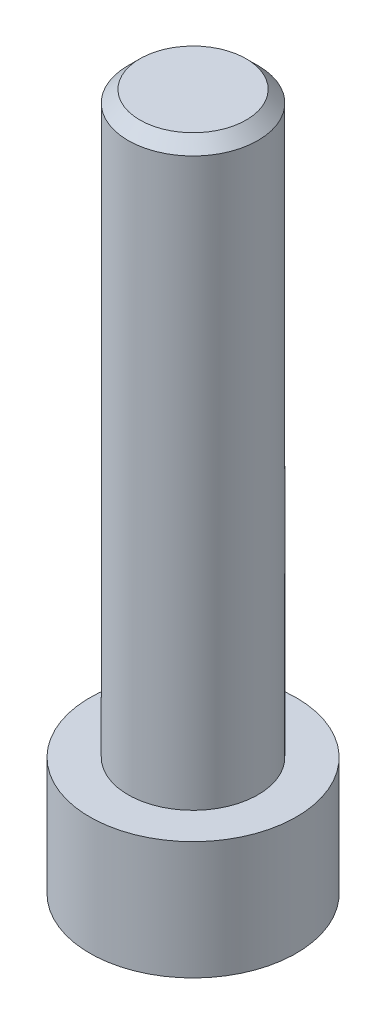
ISO-10303-21;
HEADER;
FILE_DESCRIPTION(('STEP AP214'),'2;1');
FILE_NAME('part.step','',(''),(''),'','','');
FILE_SCHEMA(('AUTOMOTIVE_DESIGN { 1 0 10303 214 1 1 1 1 }'));
ENDSEC;
DATA;
#1=APPLICATION_CONTEXT('core data for automotive mechanical design processes');
#2=APPLICATION_PROTOCOL_DEFINITION('international standard','automotive_design',2000,#1);
#3=PRODUCT_CONTEXT('',#1,'mechanical');
#4=PRODUCT('Part','Part','',(#3));
#5=PRODUCT_RELATED_PRODUCT_CATEGORY('part','',(#4));
#6=PRODUCT_DEFINITION_FORMATION('','',#4);
#7=PRODUCT_DEFINITION_CONTEXT('part definition',#1,'design');
#8=PRODUCT_DEFINITION('design','',#6,#7);
#9=PRODUCT_DEFINITION_SHAPE('','',#8);
#10=(LENGTH_UNIT() NAMED_UNIT(*) SI_UNIT(.MILLI.,.METRE.));
#11=(NAMED_UNIT(*) PLANE_ANGLE_UNIT() SI_UNIT($,.RADIAN.));
#12=(NAMED_UNIT(*) SI_UNIT($,.STERADIAN.) SOLID_ANGLE_UNIT());
#13=UNCERTAINTY_MEASURE_WITH_UNIT(LENGTH_MEASURE(1.E-05),#10,'distance_accuracy_value','');
#14=(GEOMETRIC_REPRESENTATION_CONTEXT(3) GLOBAL_UNCERTAINTY_ASSIGNED_CONTEXT((#13)) GLOBAL_UNIT_ASSIGNED_CONTEXT((#10,
#11,#12)) REPRESENTATION_CONTEXT('',''));
#15=CARTESIAN_POINT('',(0.,0.,0.));
#16=DIRECTION('',(0.,0.,1.));
#17=DIRECTION('',(1.,0.,0.));
#18=AXIS2_PLACEMENT_3D('',#15,#16,#17);
#19=CARTESIAN_POINT('',(14.518,-10.1170000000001,22.4846));
#20=DIRECTION('',(0.,1.,0.));
#21=DIRECTION('',(0.,0.,1.));
#22=AXIS2_PLACEMENT_3D('',#19,#20,#21);
#23=PLANE('',#22);
#24=DIRECTION('',(-1.,0.,0.));
#25=VECTOR('',#24,1.);
#26=CARTESIAN_POINT('',(13.883,-10.117,21.3847477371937));
#27=LINE('',#26,#25);
#28=CARTESIAN_POINT('',(13.883,-10.1170000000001,21.3847477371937));
#29=VERTEX_POINT('',#28);
#30=CARTESIAN_POINT('',(15.153,-10.1170000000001,21.3847477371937));
#31=VERTEX_POINT('',#30);
#32=EDGE_CURVE('E90',#29,#31,#27,.F.);
#33=ORIENTED_EDGE('',*,*,#32,.T.);
#34=DIRECTION('',(-0.500000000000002,0.,-0.866025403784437));
#35=VECTOR('',#34,1.);
#36=CARTESIAN_POINT('',(15.153,-10.117,21.3847477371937));
#37=LINE('',#36,#35);
#38=CARTESIAN_POINT('',(15.788,-10.1170000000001,22.4846));
#39=VERTEX_POINT('',#38);
#40=EDGE_CURVE('E93',#31,#39,#37,.F.);
#41=ORIENTED_EDGE('',*,*,#40,.T.);
#42=DIRECTION('',(0.5,0.,-0.866025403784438));
#43=VECTOR('',#42,1.);
#44=CARTESIAN_POINT('',(15.788,-10.1170000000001,22.4846));
#45=LINE('',#44,#43);
#46=CARTESIAN_POINT('',(15.153,-10.1170000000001,23.5844522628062));
#47=VERTEX_POINT('',#46);
#48=EDGE_CURVE('E111',#39,#47,#45,.F.);
#49=ORIENTED_EDGE('',*,*,#48,.T.);
#50=DIRECTION('',(1.,0.,0.));
#51=VECTOR('',#50,1.);
#52=CARTESIAN_POINT('',(15.153,-10.117,23.5844522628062));
#53=LINE('',#52,#51);
#54=CARTESIAN_POINT('',(13.883,-10.1170000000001,23.5844522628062));
#55=VERTEX_POINT('',#54);
#56=EDGE_CURVE('E116',#47,#55,#53,.F.);
#57=ORIENTED_EDGE('',*,*,#56,.T.);
#58=DIRECTION('',(0.500000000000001,0.,0.866025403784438));
#59=VECTOR('',#58,1.);
#60=CARTESIAN_POINT('',(13.883,-10.117,23.5844522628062));
#61=LINE('',#60,#59);
#62=CARTESIAN_POINT('',(13.248,-10.1170000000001,22.4846));
#63=VERTEX_POINT('',#62);
#64=EDGE_CURVE('E78',#55,#63,#61,.F.);
#65=ORIENTED_EDGE('',*,*,#64,.T.);
#66=DIRECTION('',(-0.5,0.,0.866025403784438));
#67=VECTOR('',#66,1.);
#68=CARTESIAN_POINT('',(13.248,-10.1170000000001,22.4846));
#69=LINE('',#68,#67);
#70=EDGE_CURVE('E96',#63,#29,#69,.F.);
#71=ORIENTED_EDGE('',*,*,#70,.T.);
#72=EDGE_LOOP('',(#33,#41,#49,#57,#65,#71));
#73=FACE_BOUND('',#72,.T.);
#74=ADVANCED_FACE('F34',(#73),#23,.F.);
#75=CARTESIAN_POINT('',(13.883,-11.641,21.3847477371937));
#76=DIRECTION('',(0.,0.,-1.));
#77=DIRECTION('',(-1.,0.,0.));
#78=AXIS2_PLACEMENT_3D('',#75,#76,#77);
#79=PLANE('',#78);
#80=DIRECTION('',(0.,1.,0.));
#81=VECTOR('',#80,1.);
#82=CARTESIAN_POINT('',(13.883,-11.6410000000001,21.3847477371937));
#83=LINE('',#82,#81);
#84=CARTESIAN_POINT('',(13.883,-11.641,21.3847477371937));
#85=VERTEX_POINT('',#84);
#86=EDGE_CURVE('E71',#29,#85,#83,.F.);
#87=ORIENTED_EDGE('',*,*,#86,.T.);
#88=DIRECTION('',(1.,0.,0.));
#89=VECTOR('',#88,1.);
#90=CARTESIAN_POINT('',(14.7200454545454,-11.6410000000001,21.3847477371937));
#91=LINE('',#90,#89);
#92=CARTESIAN_POINT('',(15.153,-11.641,21.3847477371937));
#93=VERTEX_POINT('',#92);
#94=EDGE_CURVE('E102',#85,#93,#91,.T.);
#95=ORIENTED_EDGE('',*,*,#94,.T.);
#96=DIRECTION('',(0.,1.,0.));
#97=VECTOR('',#96,1.);
#98=CARTESIAN_POINT('',(15.153,-11.641,21.3847477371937));
#99=LINE('',#98,#97);
#100=EDGE_CURVE('E97',#93,#31,#99,.T.);
#101=ORIENTED_EDGE('',*,*,#100,.T.);
#102=ORIENTED_EDGE('',*,*,#32,.F.);
#103=EDGE_LOOP('',(#87,#95,#101,#102));
#104=FACE_BOUND('',#103,.T.);
#105=ADVANCED_FACE('F100',(#104),#79,.F.);
#106=CARTESIAN_POINT('',(15.153,-11.641,21.3847477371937));
#107=DIRECTION('',(0.866025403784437,0.,-0.500000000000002));
#108=DIRECTION('',(-0.500000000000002,0.,-0.866025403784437));
#109=AXIS2_PLACEMENT_3D('',#106,#107,#108);
#110=PLANE('',#109);
#111=ORIENTED_EDGE('',*,*,#100,.F.);
#112=DIRECTION('',(0.500000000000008,0.,0.866025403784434));
#113=VECTOR('',#112,1.);
#114=CARTESIAN_POINT('',(15.153,-11.6410000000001,21.3847477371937));
#115=LINE('',#114,#113);
#116=CARTESIAN_POINT('',(15.788,-11.641,22.4846));
#117=VERTEX_POINT('',#116);
#118=EDGE_CURVE('E136',#93,#117,#115,.T.);
#119=ORIENTED_EDGE('',*,*,#118,.T.);
#120=DIRECTION('',(0.,1.,0.));
#121=VECTOR('',#120,1.);
#122=CARTESIAN_POINT('',(15.788,-11.6410000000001,22.4846));
#123=LINE('',#122,#121);
#124=EDGE_CURVE('E108',#117,#39,#123,.T.);
#125=ORIENTED_EDGE('',*,*,#124,.T.);
#126=ORIENTED_EDGE('',*,*,#40,.F.);
#127=EDGE_LOOP('',(#111,#119,#125,#126));
#128=FACE_BOUND('',#127,.T.);
#129=ADVANCED_FACE('F106',(#128),#110,.F.);
#130=CARTESIAN_POINT('',(15.788,-11.6410000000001,22.4846));
#131=DIRECTION('',(0.866025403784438,0.,0.5));
#132=DIRECTION('',(0.5,0.,-0.866025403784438));
#133=AXIS2_PLACEMENT_3D('',#130,#131,#132);
#134=PLANE('',#133);
#135=ORIENTED_EDGE('',*,*,#124,.F.);
#136=DIRECTION('',(-0.499999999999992,0.,0.866025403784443));
#137=VECTOR('',#136,1.);
#138=CARTESIAN_POINT('',(15.788,-11.6410000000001,22.4846));
#139=LINE('',#138,#137);
#140=CARTESIAN_POINT('',(15.153,-11.641,23.5844522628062));
#141=VERTEX_POINT('',#140);
#142=EDGE_CURVE('E134',#117,#141,#139,.T.);
#143=ORIENTED_EDGE('',*,*,#142,.T.);
#144=DIRECTION('',(0.,1.,0.));
#145=VECTOR('',#144,1.);
#146=CARTESIAN_POINT('',(15.153,-11.641,23.5844522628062));
#147=LINE('',#146,#145);
#148=EDGE_CURVE('E114',#141,#47,#147,.T.);
#149=ORIENTED_EDGE('',*,*,#148,.T.);
#150=ORIENTED_EDGE('',*,*,#48,.F.);
#151=EDGE_LOOP('',(#135,#143,#149,#150));
#152=FACE_BOUND('',#151,.T.);
#153=ADVANCED_FACE('F170',(#152),#134,.F.);
#154=CARTESIAN_POINT('',(15.153,-11.641,23.5844522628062));
#155=DIRECTION('',(0.,0.,1.));
#156=DIRECTION('',(1.,0.,0.));
#157=AXIS2_PLACEMENT_3D('',#154,#155,#156);
#158=PLANE('',#157);
#159=ORIENTED_EDGE('',*,*,#148,.F.);
#160=DIRECTION('',(1.,0.,0.));
#161=VECTOR('',#160,1.);
#162=CARTESIAN_POINT('',(14.7200454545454,-11.6410000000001,23.5844522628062));
#163=LINE('',#162,#161);
#164=CARTESIAN_POINT('',(13.883,-11.641,23.5844522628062));
#165=VERTEX_POINT('',#164);
#166=EDGE_CURVE('E132',#141,#165,#163,.F.);
#167=ORIENTED_EDGE('',*,*,#166,.T.);
#168=DIRECTION('',(0.,1.,0.));
#169=VECTOR('',#168,1.);
#170=CARTESIAN_POINT('',(13.883,-11.641,23.5844522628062));
#171=LINE('',#170,#169);
#172=EDGE_CURVE('E118',#165,#55,#171,.T.);
#173=ORIENTED_EDGE('',*,*,#172,.T.);
#174=ORIENTED_EDGE('',*,*,#56,.F.);
#175=EDGE_LOOP('',(#159,#167,#173,#174));
#176=FACE_BOUND('',#175,.T.);
#177=ADVANCED_FACE('F173',(#176),#158,.F.);
#178=CARTESIAN_POINT('',(13.883,-11.641,23.5844522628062));
#179=DIRECTION('',(-0.866025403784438,0.,0.500000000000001));
#180=DIRECTION('',(0.500000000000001,0.,0.866025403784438));
#181=AXIS2_PLACEMENT_3D('',#178,#179,#180);
#182=PLANE('',#181);
#183=ORIENTED_EDGE('',*,*,#172,.F.);
#184=DIRECTION('',(-0.499999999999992,0.,-0.866025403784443));
#185=VECTOR('',#184,1.);
#186=CARTESIAN_POINT('',(13.883,-11.6410000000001,23.5844522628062));
#187=LINE('',#186,#185);
#188=CARTESIAN_POINT('',(13.248,-11.641,22.4846));
#189=VERTEX_POINT('',#188);
#190=EDGE_CURVE('E51',#165,#189,#187,.T.);
#191=ORIENTED_EDGE('',*,*,#190,.T.);
#192=DIRECTION('',(0.,1.,0.));
#193=VECTOR('',#192,1.);
#194=CARTESIAN_POINT('',(13.248,-11.6410000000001,22.4846));
#195=LINE('',#194,#193);
#196=EDGE_CURVE('E125',#189,#63,#195,.T.);
#197=ORIENTED_EDGE('',*,*,#196,.T.);
#198=ORIENTED_EDGE('',*,*,#64,.F.);
#199=EDGE_LOOP('',(#183,#191,#197,#198));
#200=FACE_BOUND('',#199,.T.);
#201=ADVANCED_FACE('F177',(#200),#182,.F.);
#202=CARTESIAN_POINT('',(13.248,-11.6410000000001,22.4846));
#203=DIRECTION('',(-0.866025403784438,0.,-0.5));
#204=DIRECTION('',(-0.5,0.,0.866025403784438));
#205=AXIS2_PLACEMENT_3D('',#202,#203,#204);
#206=PLANE('',#205);
#207=ORIENTED_EDGE('',*,*,#196,.F.);
#208=DIRECTION('',(0.500000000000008,0.,-0.866025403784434));
#209=VECTOR('',#208,1.);
#210=CARTESIAN_POINT('',(13.248,-11.6410000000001,22.4846));
#211=LINE('',#210,#209);
#212=EDGE_CURVE('E128',#189,#85,#211,.T.);
#213=ORIENTED_EDGE('',*,*,#212,.T.);
#214=ORIENTED_EDGE('',*,*,#86,.F.);
#215=ORIENTED_EDGE('',*,*,#70,.F.);
#216=EDGE_LOOP('',(#207,#213,#214,#215));
#217=FACE_BOUND('',#216,.T.);
#218=ADVANCED_FACE('F181',(#217),#206,.F.);
#219=CARTESIAN_POINT('',(14.7200454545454,-11.6410000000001,22.4846));
#220=DIRECTION('',(0.,1.,0.));
#221=DIRECTION('',(0.,0.,1.));
#222=AXIS2_PLACEMENT_3D('',#219,#220,#221);
#223=PLANE('',#222);
#224=ORIENTED_EDGE('',*,*,#190,.F.);
#225=ORIENTED_EDGE('',*,*,#166,.F.);
#226=ORIENTED_EDGE('',*,*,#142,.F.);
#227=ORIENTED_EDGE('',*,*,#118,.F.);
#228=ORIENTED_EDGE('',*,*,#94,.F.);
#229=ORIENTED_EDGE('',*,*,#212,.F.);
#230=EDGE_LOOP('',(#224,#225,#226,#227,#228,#229));
#231=FACE_BOUND('',#230,.T.);
#232=CARTESIAN_POINT('',(14.518,-11.6410000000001,22.4846));
#233=DIRECTION('',(0.,-1.,0.));
#234=DIRECTION('',(0.,0.,-1.));
#235=AXIS2_PLACEMENT_3D('',#232,#233,#234);
#236=CIRCLE('',#235,2.2225);
#237=CARTESIAN_POINT('',(14.518,-11.6410000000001,20.2621));
#238=VERTEX_POINT('',#237);
#239=EDGE_CURVE('E130',#238,#238,#236,.F.);
#240=ORIENTED_EDGE('',*,*,#239,.F.);
#241=EDGE_LOOP('',(#240));
#242=FACE_BOUND('',#241,.T.);
#243=ADVANCED_FACE('F184',(#231,#242),#223,.F.);
#244=CARTESIAN_POINT('',(14.518,-9.10100000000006,22.4846));
#245=DIRECTION('',(0.,-1.,0.));
#246=DIRECTION('',(0.,0.,-1.));
#247=AXIS2_PLACEMENT_3D('',#244,#245,#246);
#248=CYLINDRICAL_SURFACE('',#247,2.2225);
#249=ORIENTED_EDGE('',*,*,#239,.T.);
#250=EDGE_LOOP('',(#249));
#251=FACE_BOUND('',#250,.T.);
#252=CARTESIAN_POINT('',(14.518,-9.10100000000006,22.4846));
#253=DIRECTION('',(0.,-1.,0.));
#254=DIRECTION('',(0.,0.,-1.));
#255=AXIS2_PLACEMENT_3D('',#252,#253,#254);
#256=CIRCLE('',#255,2.2225);
#257=CARTESIAN_POINT('',(14.518,-9.10100000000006,20.2621));
#258=VERTEX_POINT('',#257);
#259=EDGE_CURVE('E142',#258,#258,#256,.F.);
#260=ORIENTED_EDGE('',*,*,#259,.F.);
#261=EDGE_LOOP('',(#260));
#262=FACE_BOUND('',#261,.T.);
#263=ADVANCED_FACE('F188',(#251,#262),#248,.T.);
#264=CARTESIAN_POINT('',(14.645,3.34499999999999,22.4846));
#265=DIRECTION('',(0.,1.,0.));
#266=DIRECTION('',(0.,0.,1.));
#267=AXIS2_PLACEMENT_3D('',#264,#265,#266);
#268=PLANE('',#267);
#269=CARTESIAN_POINT('',(14.518,3.34499999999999,22.4846));
#270=DIRECTION('',(0.,1.,0.));
#271=DIRECTION('',(0.,0.,1.));
#272=AXIS2_PLACEMENT_3D('',#269,#270,#271);
#273=CIRCLE('',#272,1.143);
#274=CARTESIAN_POINT('',(14.518,3.34499999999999,23.6276));
#275=VERTEX_POINT('',#274);
#276=EDGE_CURVE('E11',#275,#275,#273,.T.);
#277=ORIENTED_EDGE('',*,*,#276,.T.);
#278=EDGE_LOOP('',(#277));
#279=FACE_BOUND('',#278,.T.);
#280=ADVANCED_FACE('F192',(#279),#268,.T.);
#281=CARTESIAN_POINT('',(14.7200454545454,-9.10100000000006,22.4846));
#282=DIRECTION('',(0.,1.,0.));
#283=DIRECTION('',(0.,0.,1.));
#284=AXIS2_PLACEMENT_3D('',#281,#282,#283);
#285=PLANE('',#284);
#286=CARTESIAN_POINT('',(14.518,-9.10100000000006,22.4846));
#287=DIRECTION('',(0.,-1.,0.));
#288=DIRECTION('',(0.,0.,-1.));
#289=AXIS2_PLACEMENT_3D('',#286,#287,#288);
#290=CIRCLE('',#289,1.397);
#291=CARTESIAN_POINT('',(14.518,-9.10100000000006,21.0876));
#292=VERTEX_POINT('',#291);
#293=EDGE_CURVE('E139',#292,#292,#290,.F.);
#294=ORIENTED_EDGE('',*,*,#293,.F.);
#295=EDGE_LOOP('',(#294));
#296=FACE_BOUND('',#295,.T.);
#297=ORIENTED_EDGE('',*,*,#259,.T.);
#298=EDGE_LOOP('',(#297));
#299=FACE_BOUND('',#298,.T.);
#300=ADVANCED_FACE('F158',(#296,#299),#285,.T.);
#301=CARTESIAN_POINT('',(14.518,3.34499999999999,22.4846));
#302=DIRECTION('',(0.,-1.,0.));
#303=DIRECTION('',(0.,0.,-1.));
#304=AXIS2_PLACEMENT_3D('',#301,#302,#303);
#305=CYLINDRICAL_SURFACE('',#304,1.397);
#306=CARTESIAN_POINT('',(14.518,3.09099999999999,22.4846));
#307=DIRECTION('',(0.,1.,0.));
#308=DIRECTION('',(0.,0.,1.));
#309=AXIS2_PLACEMENT_3D('',#306,#307,#308);
#310=CIRCLE('',#309,1.397);
#311=CARTESIAN_POINT('',(14.518,3.09099999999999,23.8816));
#312=VERTEX_POINT('',#311);
#313=EDGE_CURVE('E43',#312,#312,#310,.F.);
#314=ORIENTED_EDGE('',*,*,#313,.T.);
#315=EDGE_LOOP('',(#314));
#316=FACE_BOUND('',#315,.T.);
#317=ORIENTED_EDGE('',*,*,#293,.T.);
#318=EDGE_LOOP('',(#317));
#319=FACE_BOUND('',#318,.T.);
#320=ADVANCED_FACE('F149',(#316,#319),#305,.T.);
#321=CARTESIAN_POINT('',(14.518,3.09099999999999,22.4846));
#322=DIRECTION('',(0.,-1.,0.));
#323=DIRECTION('',(0.,0.,-1.));
#324=AXIS2_PLACEMENT_3D('',#321,#322,#323);
#325=CONICAL_SURFACE('',#324,1.397,0.785398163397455);
#326=ORIENTED_EDGE('',*,*,#276,.F.);
#327=EDGE_LOOP('',(#326));
#328=FACE_BOUND('',#327,.T.);
#329=ORIENTED_EDGE('',*,*,#313,.F.);
#330=EDGE_LOOP('',(#329));
#331=FACE_BOUND('',#330,.T.);
#332=ADVANCED_FACE('F36',(#328,#331),#325,.T.);
#333=CLOSED_SHELL('',(#74,#105,#129,#153,#177,#201,#218,#243,#263,#280,#300,#320,#332));
#334=MANIFOLD_SOLID_BREP('B2',#333);
#335=ADVANCED_BREP_SHAPE_REPRESENTATION('',(#18,#334),#14);
#336=SHAPE_DEFINITION_REPRESENTATION(#9,#335);
ENDSEC;
END-ISO-10303-21;
